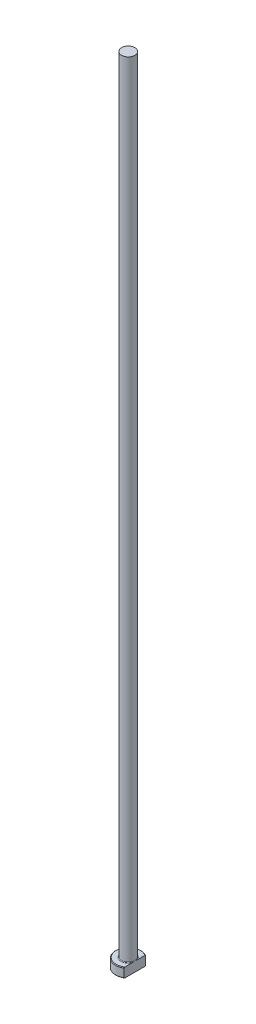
ISO-10303-21;
HEADER;
FILE_DESCRIPTION(('STEP AP214'),'2;1');
FILE_NAME('part.step','',(''),(''),'','','');
FILE_SCHEMA(('AUTOMOTIVE_DESIGN { 1 0 10303 214 1 1 1 1 }'));
ENDSEC;
DATA;
#1=APPLICATION_CONTEXT('core data for automotive mechanical design processes');
#2=APPLICATION_PROTOCOL_DEFINITION('international standard','automotive_design',2000,#1);
#3=PRODUCT_CONTEXT('',#1,'mechanical');
#4=PRODUCT('Part','Part','',(#3));
#5=PRODUCT_RELATED_PRODUCT_CATEGORY('part','',(#4));
#6=PRODUCT_DEFINITION_FORMATION('','',#4);
#7=PRODUCT_DEFINITION_CONTEXT('part definition',#1,'design');
#8=PRODUCT_DEFINITION('design','',#6,#7);
#9=PRODUCT_DEFINITION_SHAPE('','',#8);
#10=(LENGTH_UNIT() NAMED_UNIT(*) SI_UNIT(.MILLI.,.METRE.));
#11=(NAMED_UNIT(*) PLANE_ANGLE_UNIT() SI_UNIT($,.RADIAN.));
#12=(NAMED_UNIT(*) SI_UNIT($,.STERADIAN.) SOLID_ANGLE_UNIT());
#13=UNCERTAINTY_MEASURE_WITH_UNIT(LENGTH_MEASURE(1.E-05),#10,'distance_accuracy_value','');
#14=(GEOMETRIC_REPRESENTATION_CONTEXT(3) GLOBAL_UNCERTAINTY_ASSIGNED_CONTEXT((#13)) GLOBAL_UNIT_ASSIGNED_CONTEXT((#10,
#11,#12)) REPRESENTATION_CONTEXT('',''));
#15=CARTESIAN_POINT('',(0.,0.,0.));
#16=DIRECTION('',(0.,0.,1.));
#17=DIRECTION('',(1.,0.,0.));
#18=AXIS2_PLACEMENT_3D('',#15,#16,#17);
#19=CARTESIAN_POINT('',(0.,0.,0.));
#20=DIRECTION('',(0.,-1.,0.));
#21=DIRECTION('',(0.,0.,-1.));
#22=AXIS2_PLACEMENT_3D('',#19,#20,#21);
#23=PLANE('',#22);
#24=CARTESIAN_POINT('',(0.,0.,0.));
#25=DIRECTION('',(0.,-1.,0.));
#26=DIRECTION('',(0.,0.,-1.));
#27=AXIS2_PLACEMENT_3D('',#24,#25,#26);
#28=CIRCLE('',#27,3.79999999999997);
#29=CARTESIAN_POINT('',(2.09999999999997,0.,3.16701752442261));
#30=VERTEX_POINT('',#29);
#31=CARTESIAN_POINT('',(2.09999999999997,0.,-3.16701752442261));
#32=VERTEX_POINT('',#31);
#33=EDGE_CURVE('E98',#30,#32,#28,.T.);
#34=ORIENTED_EDGE('',*,*,#33,.T.);
#35=DIRECTION('',(0.,0.,1.));
#36=VECTOR('',#35,1.);
#37=CARTESIAN_POINT('',(2.09999999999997,0.,-3.40440890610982));
#38=LINE('',#37,#36);
#39=EDGE_CURVE('E83',#32,#30,#38,.T.);
#40=ORIENTED_EDGE('',*,*,#39,.T.);
#41=EDGE_LOOP('',(#34,#40));
#42=FACE_BOUND('',#41,.T.);
#43=ADVANCED_FACE('F32',(#42),#23,.T.);
#44=CARTESIAN_POINT('',(0.,259.958771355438,0.));
#45=DIRECTION('',(0.,1.,0.));
#46=DIRECTION('',(0.,0.,1.));
#47=AXIS2_PLACEMENT_3D('',#44,#45,#46);
#48=CYLINDRICAL_SURFACE('',#47,3.99999999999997);
#49=CARTESIAN_POINT('',(0.,2.80000000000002,0.));
#50=DIRECTION('',(0.,1.,0.));
#51=DIRECTION('',(0.,0.,1.));
#52=AXIS2_PLACEMENT_3D('',#49,#50,#51);
#53=CIRCLE('',#52,3.99999999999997);
#54=CARTESIAN_POINT('',(2.09999999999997,2.80000000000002,3.40440890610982));
#55=VERTEX_POINT('',#54);
#56=CARTESIAN_POINT('',(2.09999999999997,2.80000000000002,-3.40440890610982));
#57=VERTEX_POINT('',#56);
#58=EDGE_CURVE('E104',#55,#57,#53,.F.);
#59=ORIENTED_EDGE('',*,*,#58,.T.);
#60=DIRECTION('',(0.,-1.,0.));
#61=VECTOR('',#60,1.);
#62=CARTESIAN_POINT('',(2.09999999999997,250.,-3.40440890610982));
#63=LINE('',#62,#61);
#64=CARTESIAN_POINT('',(2.09999999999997,0.200000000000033,-3.40440890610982));
#65=VERTEX_POINT('',#64);
#66=EDGE_CURVE('E183',#57,#65,#63,.T.);
#67=ORIENTED_EDGE('',*,*,#66,.T.);
#68=CARTESIAN_POINT('',(0.,0.200000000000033,0.));
#69=DIRECTION('',(0.,-1.,0.));
#70=DIRECTION('',(0.,0.,-1.));
#71=AXIS2_PLACEMENT_3D('',#68,#69,#70);
#72=CIRCLE('',#71,3.99999999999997);
#73=CARTESIAN_POINT('',(2.09999999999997,0.200000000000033,3.40440890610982));
#74=VERTEX_POINT('',#73);
#75=EDGE_CURVE('E100',#65,#74,#72,.F.);
#76=ORIENTED_EDGE('',*,*,#75,.T.);
#77=DIRECTION('',(0.,-1.,0.));
#78=VECTOR('',#77,1.);
#79=CARTESIAN_POINT('',(2.09999999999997,250.,3.40440890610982));
#80=LINE('',#79,#78);
#81=EDGE_CURVE('E93',#55,#74,#80,.T.);
#82=ORIENTED_EDGE('',*,*,#81,.F.);
#83=EDGE_LOOP('',(#59,#67,#76,#82));
#84=FACE_BOUND('',#83,.T.);
#85=ADVANCED_FACE('F158',(#84),#48,.T.);
#86=CARTESIAN_POINT('',(-3.99999999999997,3.,0.));
#87=DIRECTION('',(0.,1.,0.));
#88=DIRECTION('',(0.,0.,1.));
#89=AXIS2_PLACEMENT_3D('',#86,#87,#88);
#90=PLANE('',#89);
#91=CARTESIAN_POINT('',(0.,3.,0.));
#92=DIRECTION('',(0.,1.,0.));
#93=DIRECTION('',(0.,0.,1.));
#94=AXIS2_PLACEMENT_3D('',#91,#92,#93);
#95=CIRCLE('',#94,3.8);
#96=CARTESIAN_POINT('',(2.09999999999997,3.,-3.16701752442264));
#97=VERTEX_POINT('',#96);
#98=CARTESIAN_POINT('',(2.09999999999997,3.,3.16701752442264));
#99=VERTEX_POINT('',#98);
#100=EDGE_CURVE('E178',#97,#99,#95,.T.);
#101=ORIENTED_EDGE('',*,*,#100,.T.);
#102=DIRECTION('',(0.,0.,-1.));
#103=VECTOR('',#102,1.);
#104=CARTESIAN_POINT('',(2.09999999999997,3.,0.));
#105=LINE('',#104,#103);
#106=CARTESIAN_POINT('',(2.09999999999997,2.99999999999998,0.938083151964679));
#107=VERTEX_POINT('',#106);
#108=EDGE_CURVE('E57',#99,#107,#105,.T.);
#109=ORIENTED_EDGE('',*,*,#108,.T.);
#110=CARTESIAN_POINT('',(0.,3.,0.));
#111=DIRECTION('',(0.,1.,0.));
#112=DIRECTION('',(0.,0.,1.));
#113=AXIS2_PLACEMENT_3D('',#110,#111,#112);
#114=CIRCLE('',#113,2.29999999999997);
#115=CARTESIAN_POINT('',(2.09999999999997,2.99999999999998,-0.938083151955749));
#116=VERTEX_POINT('',#115);
#117=EDGE_CURVE('E107',#107,#116,#114,.F.);
#118=ORIENTED_EDGE('',*,*,#117,.T.);
#119=EDGE_CURVE('E136',#116,#97,#105,.T.);
#120=ORIENTED_EDGE('',*,*,#119,.T.);
#121=EDGE_LOOP('',(#101,#109,#118,#120));
#122=FACE_BOUND('',#121,.T.);
#123=ADVANCED_FACE('F147',(#122),#90,.T.);
#124=CARTESIAN_POINT('',(0.,3.,0.));
#125=DIRECTION('',(0.,-1.,0.));
#126=DIRECTION('',(0.,0.,-1.));
#127=AXIS2_PLACEMENT_3D('',#124,#125,#126);
#128=CONICAL_SURFACE('',#127,3.8,0.785398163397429);
#129=ORIENTED_EDGE('',*,*,#58,.F.);
#130=CARTESIAN_POINT('',(2.09999999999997,-0.980423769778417,7.49166163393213));
#131=CARTESIAN_POINT('',(2.09999999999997,-0.831474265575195,7.33696373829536));
#132=CARTESIAN_POINT('',(2.09999999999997,-0.682692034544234,7.1821043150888));
#133=CARTESIAN_POINT('',(2.09999999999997,-0.385548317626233,6.87197961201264));
#134=CARTESIAN_POINT('',(2.09999999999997,-0.237186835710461,6.71671432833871));
#135=CARTESIAN_POINT('',(2.09999999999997,0.0590779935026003,6.40564381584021));
#136=CARTESIAN_POINT('',(2.09999999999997,0.206981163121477,6.24983841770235));
#137=CARTESIAN_POINT('',(2.09999999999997,0.502154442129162,5.9376299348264));
#138=CARTESIAN_POINT('',(2.09999999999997,0.649424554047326,5.78122685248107));
#139=CARTESIAN_POINT('',(2.09999999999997,0.940776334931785,5.47022973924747));
#140=CARTESIAN_POINT('',(2.09999999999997,1.08487085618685,5.31564775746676));
#141=CARTESIAN_POINT('',(2.09999999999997,1.37207699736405,5.0055736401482));
#142=CARTESIAN_POINT('',(2.09999999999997,1.51518862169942,4.85008150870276));
#143=CARTESIAN_POINT('',(2.09999999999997,1.80010839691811,4.53794892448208));
#144=CARTESIAN_POINT('',(2.09999999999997,1.94191674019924,4.38130864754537));
#145=CARTESIAN_POINT('',(2.09999999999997,2.22381768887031,4.0664938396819));
#146=CARTESIAN_POINT('',(2.09999999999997,2.36391033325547,3.90831934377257));
#147=CARTESIAN_POINT('',(2.09999999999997,2.60581733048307,3.63104485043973));
#148=CARTESIAN_POINT('',(2.09999999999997,2.70816653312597,3.51241214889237));
#149=CARTESIAN_POINT('',(2.09999999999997,2.9111669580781,3.27367935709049));
#150=CARTESIAN_POINT('',(2.09999999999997,3.01181801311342,3.15357912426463));
#151=CARTESIAN_POINT('',(2.09999999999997,3.2117981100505,2.91033378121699));
#152=CARTESIAN_POINT('',(2.09999999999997,3.31110514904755,2.78717050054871));
#153=CARTESIAN_POINT('',(2.09999999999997,3.50648239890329,2.53834531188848));
#154=CARTESIAN_POINT('',(2.09999999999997,3.60255343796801,2.4126840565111));
#155=CARTESIAN_POINT('',(2.09999999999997,3.79142541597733,2.15619995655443));
#156=CARTESIAN_POINT('',(2.09999999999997,3.88416307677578,2.02532985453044));
#157=CARTESIAN_POINT('',(2.09999999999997,4.01801013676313,1.82534891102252));
#158=CARTESIAN_POINT('',(2.09999999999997,4.0617809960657,1.75802258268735));
#159=CARTESIAN_POINT('',(2.09999999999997,4.14708263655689,1.6219702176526));
#160=CARTESIAN_POINT('',(2.09999999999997,4.1886136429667,1.55324432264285));
#161=CARTESIAN_POINT('',(2.09999999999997,4.26843053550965,1.41491925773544));
#162=CARTESIAN_POINT('',(2.09999999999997,4.30674712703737,1.34533804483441));
#163=CARTESIAN_POINT('',(2.09999999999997,4.37989810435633,1.20437862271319));
#164=CARTESIAN_POINT('',(2.09999999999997,4.4147318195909,1.13300007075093));
#165=CARTESIAN_POINT('',(2.09999999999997,4.5124660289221,0.916193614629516));
#166=CARTESIAN_POINT('',(2.09999999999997,4.5689063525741,0.767589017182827));
#167=CARTESIAN_POINT('',(2.09999999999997,4.63146309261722,0.54504407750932));
#168=CARTESIAN_POINT('',(2.09999999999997,4.64829911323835,0.474096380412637));
#169=CARTESIAN_POINT('',(2.09999999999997,4.67524959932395,0.330910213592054));
#170=CARTESIAN_POINT('',(2.09999999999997,4.68536485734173,0.258671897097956));
#171=CARTESIAN_POINT('',(2.09999999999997,4.69814808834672,0.11383743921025));
#172=CARTESIAN_POINT('',(2.09999999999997,4.70084750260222,0.0412441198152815));
#173=CARTESIAN_POINT('',(2.09999999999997,4.69868618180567,-0.103832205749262));
#174=CARTESIAN_POINT('',(2.09999999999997,4.69382503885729,-0.176315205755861));
#175=CARTESIAN_POINT('',(2.09999999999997,4.67696192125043,-0.319913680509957));
#176=CARTESIAN_POINT('',(2.09999999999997,4.66501009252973,-0.391035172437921));
#177=CARTESIAN_POINT('',(2.09999999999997,4.63477414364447,-0.531925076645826));
#178=CARTESIAN_POINT('',(2.09999999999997,4.61648741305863,-0.60169291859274));
#179=CARTESIAN_POINT('',(2.09999999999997,4.57440952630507,-0.740018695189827));
#180=CARTESIAN_POINT('',(2.09999999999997,4.55058348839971,-0.808565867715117));
#181=CARTESIAN_POINT('',(2.09999999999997,4.49846635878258,-0.943903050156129));
#182=CARTESIAN_POINT('',(2.09999999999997,4.47017609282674,-1.01069338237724));
#183=CARTESIAN_POINT('',(2.09999999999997,4.38350646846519,-1.2006959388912));
#184=CARTESIAN_POINT('',(2.09999999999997,4.32056256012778,-1.3218187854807));
#185=CARTESIAN_POINT('',(2.09999999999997,4.18621189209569,-1.55931752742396));
#186=CARTESIAN_POINT('',(2.09999999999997,4.11479535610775,-1.67568772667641));
#187=CARTESIAN_POINT('',(2.09999999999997,3.96595132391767,-1.90511626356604));
#188=CARTESIAN_POINT('',(2.09999999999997,3.88850194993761,-2.0181602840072));
#189=CARTESIAN_POINT('',(2.09999999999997,3.72960863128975,-2.24129989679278));
#190=CARTESIAN_POINT('',(2.09999999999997,3.64816653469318,-2.3513968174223));
#191=CARTESIAN_POINT('',(2.09999999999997,3.48133411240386,-2.57073305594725));
#192=CARTESIAN_POINT('',(2.09999999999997,3.39590709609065,-2.67994433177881));
#193=CARTESIAN_POINT('',(2.09999999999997,3.22283750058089,-2.8966072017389));
#194=CARTESIAN_POINT('',(2.09999999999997,3.13519470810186,-3.00405862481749));
#195=CARTESIAN_POINT('',(2.09999999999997,2.95843815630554,-3.2173196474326));
#196=CARTESIAN_POINT('',(2.09999999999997,2.86932829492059,-3.32313248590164));
#197=CARTESIAN_POINT('',(2.09999999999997,2.68980874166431,-3.53365081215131));
#198=CARTESIAN_POINT('',(2.09999999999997,2.59939902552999,-3.63835627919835));
#199=CARTESIAN_POINT('',(2.09999999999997,2.36547490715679,-3.90659393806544));
#200=CARTESIAN_POINT('',(2.09999999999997,2.22120602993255,-4.06946765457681));
#201=CARTESIAN_POINT('',(2.09999999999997,1.93085962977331,-4.39359699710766));
#202=CARTESIAN_POINT('',(2.09999999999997,1.78478206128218,-4.55485258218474));
#203=CARTESIAN_POINT('',(2.09999999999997,1.49115582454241,-4.87627982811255));
#204=CARTESIAN_POINT('',(2.09999999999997,1.34360596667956,-5.03645040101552));
#205=CARTESIAN_POINT('',(2.09999999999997,1.04748117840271,-5.3558413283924));
#206=CARTESIAN_POINT('',(2.09999999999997,0.89890624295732,-5.51506167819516));
#207=CARTESIAN_POINT('',(2.09999999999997,0.463656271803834,-5.97917774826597));
#208=CARTESIAN_POINT('',(2.09999999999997,0.175917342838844,-6.28307552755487));
#209=CARTESIAN_POINT('',(2.09999999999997,-0.256953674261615,-6.73740739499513));
#210=CARTESIAN_POINT('',(2.09999999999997,-0.401377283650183,-6.88851889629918));
#211=CARTESIAN_POINT('',(2.09999999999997,-0.690621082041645,-7.1903594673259));
#212=CARTESIAN_POINT('',(2.09999999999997,-0.835441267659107,-7.34108854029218));
#213=CARTESIAN_POINT('',(2.09999999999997,-0.980423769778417,-7.49166163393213));
#214=B_SPLINE_CURVE_WITH_KNOTS('',3,(#130,#131,#132,#133,#134,#135,#136,#137,#138,#139,#140,
#141,#142,#143,#144,#145,#146,#147,#148,#149,#150,#151,#152,#153,#154,#155,#156,#157,#158,#159,
#160,#161,#162,#163,#164,#165,#166,#167,#168,#169,#170,#171,#172,#173,#174,#175,#176,#177,#178,
#179,#180,#181,#182,#183,#184,#185,#186,#187,#188,#189,#190,#191,#192,#193,#194,#195,#196,#197,
#198,#199,#200,#201,#202,#203,#204,#205,#206,#207,#208,#209,#210,#211,#212,#213),.UNSPECIFIED.,
.F.,.F.,(4,2,2,2,2,2,2,2,2,2,2,2,2,2,2,2,2,2,2,2,2,2,2,2,2,2,2,2,2,2,2,2,2,2,2,2,2,2,2,2,2,4),
(0.,0.644249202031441,1.28850446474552,1.93298425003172,2.577461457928,3.21143723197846,
3.84541015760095,4.47928793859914,5.11315128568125,5.58318355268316,6.05326185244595,
6.52785804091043,7.00233182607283,7.48334172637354,7.72421875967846,7.96507152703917,
8.20327136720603,8.441516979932,8.91624038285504,9.13473354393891,9.35320093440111,
9.57074063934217,9.78829208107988,10.0043230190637,10.2204430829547,10.4379628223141,
10.6554423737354,11.0643686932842,11.4737715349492,11.8847351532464,12.2955103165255,
12.7114337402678,13.1273973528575,13.5423929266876,13.9573962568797,14.6101174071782,
15.2628550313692,15.9161714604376,16.5694910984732,17.8249945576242,18.452079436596,
19.0791589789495),.UNSPECIFIED.);
#215=EDGE_CURVE('E135',#55,#99,#214,.T.);
#216=ORIENTED_EDGE('',*,*,#215,.T.);
#217=ORIENTED_EDGE('',*,*,#100,.F.);
#218=EDGE_CURVE('E127',#97,#57,#214,.T.);
#219=ORIENTED_EDGE('',*,*,#218,.T.);
#220=EDGE_LOOP('',(#129,#216,#217,#219));
#221=FACE_BOUND('',#220,.T.);
#222=ADVANCED_FACE('F143',(#221),#128,.T.);
#223=CARTESIAN_POINT('',(0.,0.200000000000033,0.));
#224=DIRECTION('',(0.,1.,0.));
#225=DIRECTION('',(0.,0.,1.));
#226=AXIS2_PLACEMENT_3D('',#223,#224,#225);
#227=CONICAL_SURFACE('',#226,3.99999999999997,0.785398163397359);
#228=ORIENTED_EDGE('',*,*,#75,.F.);
#229=CARTESIAN_POINT('',(2.09999999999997,3.980423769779,-7.49166163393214));
#230=CARTESIAN_POINT('',(2.09999999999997,3.83147426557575,-7.33696373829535));
#231=CARTESIAN_POINT('',(2.09999999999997,3.68269203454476,-7.18210431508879));
#232=CARTESIAN_POINT('',(2.09999999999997,3.3855483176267,-6.87197961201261));
#233=CARTESIAN_POINT('',(2.09999999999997,3.23718683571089,-6.71671432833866));
#234=CARTESIAN_POINT('',(2.09999999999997,2.94092200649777,-6.40564381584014));
#235=CARTESIAN_POINT('',(2.09999999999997,2.79301883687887,-6.24983841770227));
#236=CARTESIAN_POINT('',(2.09999999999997,2.49784555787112,-5.9376299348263));
#237=CARTESIAN_POINT('',(2.09999999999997,2.35057544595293,-5.78122685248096));
#238=CARTESIAN_POINT('',(2.09999999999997,2.05922366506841,-5.47022973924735));
#239=CARTESIAN_POINT('',(2.09999999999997,1.91512914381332,-5.31564775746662));
#240=CARTESIAN_POINT('',(2.09999999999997,1.62792300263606,-5.00557364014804));
#241=CARTESIAN_POINT('',(2.09999999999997,1.48481137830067,-4.8500815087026));
#242=CARTESIAN_POINT('',(2.09999999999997,1.19989160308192,-4.53794892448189));
#243=CARTESIAN_POINT('',(2.09999999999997,1.05808325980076,-4.38130864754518));
#244=CARTESIAN_POINT('',(2.09999999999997,0.776182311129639,-4.06649383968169));
#245=CARTESIAN_POINT('',(2.09999999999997,0.636089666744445,-3.90831934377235));
#246=CARTESIAN_POINT('',(2.09999999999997,0.394182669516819,-3.6310448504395));
#247=CARTESIAN_POINT('',(2.09999999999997,0.291833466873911,-3.51241214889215));
#248=CARTESIAN_POINT('',(2.09999999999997,0.0888330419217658,-3.27367935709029));
#249=CARTESIAN_POINT('',(2.09999999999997,-0.0118180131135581,-3.15357912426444));
#250=CARTESIAN_POINT('',(2.09999999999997,-0.211798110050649,-2.9103337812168));
#251=CARTESIAN_POINT('',(2.09999999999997,-0.311105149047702,-2.78717050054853));
#252=CARTESIAN_POINT('',(2.09999999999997,-0.506482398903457,-2.53834531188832));
#253=CARTESIAN_POINT('',(2.09999999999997,-0.602553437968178,-2.41268405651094));
#254=CARTESIAN_POINT('',(2.09999999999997,-0.79142541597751,-2.15619995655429));
#255=CARTESIAN_POINT('',(2.09999999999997,-0.884163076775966,-2.02532985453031));
#256=CARTESIAN_POINT('',(2.09999999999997,-1.01801013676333,-1.82534891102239));
#257=CARTESIAN_POINT('',(2.09999999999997,-1.0617809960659,-1.75802258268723));
#258=CARTESIAN_POINT('',(2.09999999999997,-1.14708263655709,-1.62197021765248));
#259=CARTESIAN_POINT('',(2.09999999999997,-1.18861364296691,-1.55324432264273));
#260=CARTESIAN_POINT('',(2.09999999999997,-1.26843053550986,-1.41491925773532));
#261=CARTESIAN_POINT('',(2.09999999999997,-1.30674712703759,-1.34533804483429));
#262=CARTESIAN_POINT('',(2.09999999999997,-1.37989810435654,-1.20437862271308));
#263=CARTESIAN_POINT('',(2.09999999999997,-1.41473181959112,-1.13300007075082));
#264=CARTESIAN_POINT('',(2.09999999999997,-1.51246602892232,-0.916193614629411));
#265=CARTESIAN_POINT('',(2.09999999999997,-1.56890635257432,-0.767589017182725));
#266=CARTESIAN_POINT('',(2.09999999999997,-1.63146309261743,-0.545044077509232));
#267=CARTESIAN_POINT('',(2.09999999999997,-1.64829911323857,-0.47409638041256));
#268=CARTESIAN_POINT('',(2.09999999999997,-1.67524959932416,-0.330910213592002));
#269=CARTESIAN_POINT('',(2.09999999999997,-1.68536485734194,-0.258671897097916));
#270=CARTESIAN_POINT('',(2.09999999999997,-1.69814808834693,-0.113837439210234));
#271=CARTESIAN_POINT('',(2.09999999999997,-1.70084750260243,-0.0412441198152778));
#272=CARTESIAN_POINT('',(2.09999999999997,-1.69868618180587,0.103832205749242));
#273=CARTESIAN_POINT('',(2.09999999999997,-1.6938250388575,0.176315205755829));
#274=CARTESIAN_POINT('',(2.09999999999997,-1.67696192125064,0.319913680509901));
#275=CARTESIAN_POINT('',(2.09999999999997,-1.66501009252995,0.391035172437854));
#276=CARTESIAN_POINT('',(2.09999999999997,-1.63477414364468,0.531925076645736));
#277=CARTESIAN_POINT('',(2.09999999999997,-1.61648741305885,0.601692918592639));
#278=CARTESIAN_POINT('',(2.09999999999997,-1.5744095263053,0.740018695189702));
#279=CARTESIAN_POINT('',(2.09999999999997,-1.55058348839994,0.808565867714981));
#280=CARTESIAN_POINT('',(2.09999999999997,-1.49846635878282,0.94390305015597));
#281=CARTESIAN_POINT('',(2.09999999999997,-1.47017609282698,1.01069338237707));
#282=CARTESIAN_POINT('',(2.09999999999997,-1.38350646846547,1.20069593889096));
#283=CARTESIAN_POINT('',(2.09999999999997,-1.32056256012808,1.32181878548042));
#284=CARTESIAN_POINT('',(2.09999999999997,-1.18621189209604,1.55931752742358));
#285=CARTESIAN_POINT('',(2.09999999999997,-1.11479535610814,1.67568772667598));
#286=CARTESIAN_POINT('',(2.09999999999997,-0.965951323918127,1.90511626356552));
#287=CARTESIAN_POINT('',(2.09999999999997,-0.88850194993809,2.01816028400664));
#288=CARTESIAN_POINT('',(2.09999999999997,-0.729608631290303,2.24129989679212));
#289=CARTESIAN_POINT('',(2.09999999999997,-0.648166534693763,2.3513968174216));
#290=CARTESIAN_POINT('',(2.09999999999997,-0.481334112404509,2.57073305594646));
#291=CARTESIAN_POINT('',(2.09999999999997,-0.395907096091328,2.67994433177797));
#292=CARTESIAN_POINT('',(2.09999999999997,-0.222837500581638,2.89660720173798));
#293=CARTESIAN_POINT('',(2.09999999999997,-0.135194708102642,3.00405862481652));
#294=CARTESIAN_POINT('',(2.09999999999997,0.0415618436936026,3.21731964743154));
#295=CARTESIAN_POINT('',(2.09999999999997,0.130671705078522,3.32313248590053));
#296=CARTESIAN_POINT('',(2.09999999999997,0.310191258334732,3.53365081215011));
#297=CARTESIAN_POINT('',(2.09999999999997,0.400600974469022,3.6383562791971));
#298=CARTESIAN_POINT('',(2.09999999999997,0.634525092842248,3.90659393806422));
#299=CARTESIAN_POINT('',(2.09999999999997,0.778793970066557,4.06946765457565));
#300=CARTESIAN_POINT('',(2.09999999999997,1.06914037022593,4.39359699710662));
#301=CARTESIAN_POINT('',(2.09999999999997,1.21521793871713,4.55485258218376));
#302=CARTESIAN_POINT('',(2.09999999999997,1.50884417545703,4.87627982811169));
#303=CARTESIAN_POINT('',(2.09999999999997,1.65639403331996,5.03645040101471));
#304=CARTESIAN_POINT('',(2.09999999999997,1.95251882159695,5.35584132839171));
#305=CARTESIAN_POINT('',(2.09999999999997,2.10109375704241,5.51506167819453));
#306=CARTESIAN_POINT('',(2.09999999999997,2.5363437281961,5.9791777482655));
#307=CARTESIAN_POINT('',(2.09999999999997,2.82408265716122,6.28307552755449));
#308=CARTESIAN_POINT('',(2.09999999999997,3.25695367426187,6.73740739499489));
#309=CARTESIAN_POINT('',(2.09999999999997,3.40137728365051,6.88851889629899));
#310=CARTESIAN_POINT('',(2.09999999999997,3.6906210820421,7.1903594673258));
#311=CARTESIAN_POINT('',(2.09999999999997,3.83544126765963,7.34108854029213));
#312=CARTESIAN_POINT('',(2.09999999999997,3.980423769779,7.49166163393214));
#313=B_SPLINE_CURVE_WITH_KNOTS('',3,(#229,#230,#231,#232,#233,#234,#235,#236,#237,#238,#239,
#240,#241,#242,#243,#244,#245,#246,#247,#248,#249,#250,#251,#252,#253,#254,#255,#256,#257,#258,
#259,#260,#261,#262,#263,#264,#265,#266,#267,#268,#269,#270,#271,#272,#273,#274,#275,#276,#277,
#278,#279,#280,#281,#282,#283,#284,#285,#286,#287,#288,#289,#290,#291,#292,#293,#294,#295,#296,
#297,#298,#299,#300,#301,#302,#303,#304,#305,#306,#307,#308,#309,#310,#311,#312),.UNSPECIFIED.,
.F.,.F.,(4,2,2,2,2,2,2,2,2,2,2,2,2,2,2,2,2,2,2,2,2,2,2,2,2,2,2,2,2,2,2,2,2,2,2,2,2,2,2,2,2,4),
(0.,0.644249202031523,1.28850446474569,1.93298425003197,2.57746145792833,3.21143723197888,
3.84541015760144,4.4792879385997,5.11315128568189,5.5831835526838,6.05326185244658,
6.52785804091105,7.00233182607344,7.48334172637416,7.72421875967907,7.96507152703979,
8.20327136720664,8.4415169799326,8.91624038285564,9.13473354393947,9.35320093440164,
9.57074063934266,9.78829208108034,10.0043230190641,10.2204430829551,10.4379628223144,
10.6554423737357,11.0643686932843,11.4737715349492,11.8847351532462,12.2955103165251,
12.7114337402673,13.1273973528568,13.5423929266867,13.9573962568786,14.6101174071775,
15.2628550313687,15.9161714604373,16.5694910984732,17.8249945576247,18.4520794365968,
19.0791589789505),.UNSPECIFIED.);
#314=EDGE_CURVE('E86',#65,#32,#313,.T.);
#315=ORIENTED_EDGE('',*,*,#314,.T.);
#316=ORIENTED_EDGE('',*,*,#33,.F.);
#317=EDGE_CURVE('E89',#30,#74,#313,.T.);
#318=ORIENTED_EDGE('',*,*,#317,.T.);
#319=EDGE_LOOP('',(#228,#315,#316,#318));
#320=FACE_BOUND('',#319,.T.);
#321=ADVANCED_FACE('F97',(#320),#227,.T.);
#322=CARTESIAN_POINT('',(0.,3.19999999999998,0.));
#323=DIRECTION('',(0.,1.,0.));
#324=DIRECTION('',(0.,0.,1.));
#325=AXIS2_PLACEMENT_3D('',#322,#323,#324);
#326=TOROIDAL_SURFACE('',#325,2.29999999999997,0.2);
#327=CARTESIAN_POINT('',(2.09999999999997,3.19999999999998,0.));
#328=CARTESIAN_POINT('',(2.09999999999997,3.20000050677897,1.12871213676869E-10));
#329=CARTESIAN_POINT('',(2.09999999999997,3.20000101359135,-1.5160230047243E-07));
#330=CARTESIAN_POINT('',(2.09999999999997,3.20000197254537,-5.98005719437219E-07));
#331=CARTESIAN_POINT('',(2.09999999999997,3.2000024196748,-9.0062574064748E-07));
#332=CARTESIAN_POINT('',(2.09999999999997,3.20000332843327,-1.62318945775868E-06));
#333=CARTESIAN_POINT('',(2.09999999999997,3.20000378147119,-2.05406588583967E-06));
#334=CARTESIAN_POINT('',(2.09999999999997,3.20000461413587,-2.96308561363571E-06));
#335=CARTESIAN_POINT('',(2.09999999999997,3.20000499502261,-3.4401425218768E-06));
#336=CARTESIAN_POINT('',(2.09999999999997,3.20000634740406,-5.22586037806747E-06));
#337=CARTESIAN_POINT('',(2.09999999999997,3.20000724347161,-6.59340897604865E-06));
#338=CARTESIAN_POINT('',(2.09999999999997,3.20000877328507,-9.35203600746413E-06));
#339=CARTESIAN_POINT('',(2.09999999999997,3.20000941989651,-1.07363396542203E-05));
#340=CARTESIAN_POINT('',(2.09999999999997,3.20001201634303,-1.6407290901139E-05));
#341=CARTESIAN_POINT('',(2.09999999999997,3.20001387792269,-2.07387533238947E-05));
#342=CARTESIAN_POINT('',(2.09999999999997,3.2000167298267,-2.90585196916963E-05));
#343=CARTESIAN_POINT('',(2.09999999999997,3.20001780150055,-3.30191375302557E-05));
#344=CARTESIAN_POINT('',(2.09999999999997,3.20002541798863,-6.18759983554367E-05));
#345=CARTESIAN_POINT('',(2.09999999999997,3.20003100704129,-8.69774695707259E-05));
#346=CARTESIAN_POINT('',(2.09999999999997,3.20005545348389,-0.000185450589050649));
#347=CARTESIAN_POINT('',(2.09999999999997,3.20007895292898,-0.000257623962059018));
#348=CARTESIAN_POINT('',(2.09999999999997,3.20016974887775,-0.000541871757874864));
#349=CARTESIAN_POINT('',(2.09999999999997,3.20023388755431,-0.000754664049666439));
#350=CARTESIAN_POINT('',(2.09999999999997,3.20048929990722,-0.00159500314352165));
#351=CARTESIAN_POINT('',(2.09999999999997,3.2006844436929,-0.00222165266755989));
#352=CARTESIAN_POINT('',(2.09999999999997,3.2014903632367,-0.00481735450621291));
#353=CARTESIAN_POINT('',(2.09999999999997,3.2020963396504,-0.0067875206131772));
#354=CARTESIAN_POINT('',(2.09999999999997,3.20811857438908,-0.0263575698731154));
#355=CARTESIAN_POINT('',(2.09999999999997,3.21355673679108,-0.0439525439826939));
#356=CARTESIAN_POINT('',(2.09999999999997,3.22417769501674,-0.078471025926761));
#357=CARTESIAN_POINT('',(2.09999999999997,3.22936219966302,-0.0953940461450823));
#358=CARTESIAN_POINT('',(2.09999999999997,3.24031741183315,-0.131344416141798));
#359=CARTESIAN_POINT('',(2.09999999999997,3.24608153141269,-0.150373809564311));
#360=CARTESIAN_POINT('',(2.09999999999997,3.25756719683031,-0.188666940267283));
#361=CARTESIAN_POINT('',(2.09999999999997,3.263287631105,-0.207931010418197));
#362=CARTESIAN_POINT('',(2.09999999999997,3.27708776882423,-0.255037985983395));
#363=CARTESIAN_POINT('',(2.09999999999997,3.2850908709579,-0.282903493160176));
#364=CARTESIAN_POINT('',(2.09999999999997,3.30049018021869,-0.33805925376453));
#365=CARTESIAN_POINT('',(2.09999999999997,3.30789650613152,-0.365346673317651));
#366=CARTESIAN_POINT('',(2.09999999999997,3.32422959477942,-0.427831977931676));
#367=CARTESIAN_POINT('',(2.09999999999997,3.33299018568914,-0.46307381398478));
#368=CARTESIAN_POINT('',(2.09999999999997,3.34944378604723,-0.534083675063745));
#369=CARTESIAN_POINT('',(2.09999999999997,3.35712842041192,-0.569853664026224));
#370=CARTESIAN_POINT('',(2.09999999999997,3.37150595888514,-0.644262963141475));
#371=CARTESIAN_POINT('',(2.09999999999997,3.37808822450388,-0.682924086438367));
#372=CARTESIAN_POINT('',(2.09999999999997,3.38900927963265,-0.760558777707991));
#373=CARTESIAN_POINT('',(2.09999999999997,3.39334901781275,-0.799532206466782));
#374=CARTESIAN_POINT('',(2.09999999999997,3.39885385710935,-0.874699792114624));
#375=CARTESIAN_POINT('',(2.09999999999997,3.40023755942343,-0.910877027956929));
#376=CARTESIAN_POINT('',(2.09999999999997,3.39969515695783,-0.983205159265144));
#377=CARTESIAN_POINT('',(2.09999999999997,3.39777304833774,-1.01935603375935));
#378=CARTESIAN_POINT('',(2.09999999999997,3.39020522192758,-1.08431292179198));
#379=CARTESIAN_POINT('',(2.09999999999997,3.38533825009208,-1.11320671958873));
#380=CARTESIAN_POINT('',(2.09999999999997,3.37160685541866,-1.1700898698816));
#381=CARTESIAN_POINT('',(2.09999999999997,3.36275087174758,-1.19808099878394));
#382=CARTESIAN_POINT('',(2.09999999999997,3.34648318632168,-1.23525714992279));
#383=CARTESIAN_POINT('',(2.09999999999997,3.34148711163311,-1.24549622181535));
#384=CARTESIAN_POINT('',(2.09999999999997,3.33045865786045,-1.26542566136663));
#385=CARTESIAN_POINT('',(2.09999999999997,3.32442526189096,-1.27511547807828));
#386=CARTESIAN_POINT('',(2.09999999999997,3.31108244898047,-1.29375285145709));
#387=CARTESIAN_POINT('',(2.09999999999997,3.30375956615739,-1.30269093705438));
#388=CARTESIAN_POINT('',(2.09999999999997,3.28770931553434,-1.31920846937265));
#389=CARTESIAN_POINT('',(2.09999999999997,3.27898657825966,-1.32679222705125));
#390=CARTESIAN_POINT('',(2.09999999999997,3.26379332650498,-1.33730272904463));
#391=CARTESIAN_POINT('',(2.09999999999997,3.25778099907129,-1.34088947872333));
#392=CARTESIAN_POINT('',(2.09999999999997,3.24526530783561,-1.34707853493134));
#393=CARTESIAN_POINT('',(2.09999999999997,3.23876236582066,-1.34968167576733));
#394=CARTESIAN_POINT('',(2.09999999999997,3.22533138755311,-1.35371298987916));
#395=CARTESIAN_POINT('',(2.09999999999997,3.21840009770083,-1.35513055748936));
#396=CARTESIAN_POINT('',(2.09999999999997,3.2043942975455,-1.35660326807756));
#397=CARTESIAN_POINT('',(2.09999999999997,3.19731988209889,-1.35665928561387));
#398=CARTESIAN_POINT('',(2.09999999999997,3.18410044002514,-1.35547833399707));
#399=CARTESIAN_POINT('',(2.09999999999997,3.17794157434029,-1.3543883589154));
#400=CARTESIAN_POINT('',(2.09999999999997,3.16588195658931,-1.35123020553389));
#401=CARTESIAN_POINT('',(2.09999999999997,3.15998132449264,-1.34916157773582));
#402=CARTESIAN_POINT('',(2.09999999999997,3.14673410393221,-1.34339681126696));
#403=CARTESIAN_POINT('',(2.09999999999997,3.13952216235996,-1.33939261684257));
#404=CARTESIAN_POINT('',(2.09999999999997,3.1258371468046,-1.33027651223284));
#405=CARTESIAN_POINT('',(2.09999999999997,3.11936569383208,-1.3251622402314));
#406=CARTESIAN_POINT('',(2.09999999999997,3.10400061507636,-1.31126465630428));
#407=CARTESIAN_POINT('',(2.09999999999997,3.09558831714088,-1.3019528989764));
#408=CARTESIAN_POINT('',(2.09999999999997,3.0802757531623,-1.28218529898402));
#409=CARTESIAN_POINT('',(2.09999999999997,3.07337755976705,-1.27172791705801));
#410=CARTESIAN_POINT('',(2.09999999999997,3.05595453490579,-1.24164701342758));
#411=CARTESIAN_POINT('',(2.09999999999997,3.0467992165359,-1.22123760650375));
#412=CARTESIAN_POINT('',(2.09999999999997,3.03140603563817,-1.17923303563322));
#413=CARTESIAN_POINT('',(2.09999999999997,3.02519350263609,-1.15762930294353));
#414=CARTESIAN_POINT('',(2.09999999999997,3.014897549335,-1.11311363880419));
#415=CARTESIAN_POINT('',(2.09999999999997,3.01089884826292,-1.09018261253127));
#416=CARTESIAN_POINT('',(2.09999999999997,3.00485282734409,-1.04403569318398));
#417=CARTESIAN_POINT('',(2.09999999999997,3.00280937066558,-1.02081932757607));
#418=CARTESIAN_POINT('',(2.09999999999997,2.99913236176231,-0.952629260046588));
#419=CARTESIAN_POINT('',(2.09999999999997,2.99965574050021,-0.907543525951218));
#420=CARTESIAN_POINT('',(2.09999999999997,3.00580977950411,-0.79983290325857));
#421=CARTESIAN_POINT('',(2.09999999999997,3.01338406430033,-0.737345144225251));
#422=CARTESIAN_POINT('',(2.09999999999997,3.03389167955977,-0.611758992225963));
#423=CARTESIAN_POINT('',(2.09999999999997,3.04695134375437,-0.548682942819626));
#424=CARTESIAN_POINT('',(2.09999999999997,3.07174522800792,-0.44346393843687));
#425=CARTESIAN_POINT('',(2.09999999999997,3.08256100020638,-0.401095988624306));
#426=CARTESIAN_POINT('',(2.09999999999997,3.10517491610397,-0.317118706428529));
#427=CARTESIAN_POINT('',(2.09999999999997,3.11696109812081,-0.275506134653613));
#428=CARTESIAN_POINT('',(2.09999999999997,3.13984946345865,-0.197106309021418));
#429=CARTESIAN_POINT('',(2.09999999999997,3.15088145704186,-0.160298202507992));
#430=CARTESIAN_POINT('',(2.09999999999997,3.17371469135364,-0.0852465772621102));
#431=CARTESIAN_POINT('',(2.09999999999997,3.18552885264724,-0.0470069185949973));
#432=CARTESIAN_POINT('',(2.09999999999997,3.1979046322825,-0.00678406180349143));
#433=CARTESIAN_POINT('',(2.09999999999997,3.19851173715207,-0.0048104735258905));
#434=CARTESIAN_POINT('',(2.09999999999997,3.19931792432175,-0.00221397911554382));
#435=CARTESIAN_POINT('',(2.09999999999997,3.19951224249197,-0.00158996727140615));
#436=CARTESIAN_POINT('',(2.09999999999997,3.19976664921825,-0.000752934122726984));
#437=CARTESIAN_POINT('',(2.09999999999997,3.1998305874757,-0.000540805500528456));
#438=CARTESIAN_POINT('',(2.09999999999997,3.19992113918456,-0.00025733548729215));
#439=CARTESIAN_POINT('',(2.09999999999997,3.19994460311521,-0.000185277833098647));
#440=CARTESIAN_POINT('',(2.09999999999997,3.19996901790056,-8.69395480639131E-05));
#441=CARTESIAN_POINT('',(2.09999999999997,3.1999746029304,-6.18551879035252E-05));
#442=CARTESIAN_POINT('',(2.09999999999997,3.19998221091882,-3.30155874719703E-05));
#443=CARTESIAN_POINT('',(2.09999999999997,3.19998328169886,-2.90560037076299E-05));
#444=CARTESIAN_POINT('',(2.09999999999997,3.19998613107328,-2.07382812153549E-05));
#445=CARTESIAN_POINT('',(2.09999999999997,3.19998799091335,-1.64077754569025E-05));
#446=CARTESIAN_POINT('',(2.09999999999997,3.19999058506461,-1.0737787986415E-05));
#447=CARTESIAN_POINT('',(2.09999999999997,3.19999123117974,-9.35356155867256E-06));
#448=CARTESIAN_POINT('',(2.09999999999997,3.19999275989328,-6.59500016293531E-06));
#449=CARTESIAN_POINT('',(2.09999999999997,3.19999365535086,-5.22743189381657E-06));
#450=CARTESIAN_POINT('',(2.09999999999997,3.19999500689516,-3.44158185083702E-06));
#451=CARTESIAN_POINT('',(2.09999999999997,3.19999538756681,-2.96446374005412E-06));
#452=CARTESIAN_POINT('',(2.09999999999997,3.19999621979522,-2.05528284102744E-06));
#453=CARTESIAN_POINT('',(2.09999999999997,3.1999966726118,-1.62430552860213E-06));
#454=CARTESIAN_POINT('',(2.09999999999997,3.19999758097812,-9.01501322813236E-07));
#455=CARTESIAN_POINT('',(2.09999999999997,3.19999802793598,-5.98749119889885E-07));
#456=CARTESIAN_POINT('',(2.09999999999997,3.19999898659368,-1.52018312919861E-07));
#457=CARTESIAN_POINT('',(2.09999999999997,3.19999949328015,-1.12858037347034E-10));
#458=CARTESIAN_POINT('',(2.09999999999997,3.19999999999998,0.));
#459=B_SPLINE_CURVE_WITH_KNOTS('',3,(#327,#328,#329,#330,#331,#332,#333,#334,#335,#336,#337,
#338,#339,#340,#341,#342,#343,#344,#345,#346,#347,#348,#349,#350,#351,#352,#353,#354,#355,#356,
#357,#358,#359,#360,#361,#362,#363,#364,#365,#366,#367,#368,#369,#370,#371,#372,#373,#374,#375,
#376,#377,#378,#379,#380,#381,#382,#383,#384,#385,#386,#387,#388,#389,#390,#391,#392,#393,#394,
#395,#396,#397,#398,#399,#400,#401,#402,#403,#404,#405,#406,#407,#408,#409,#410,#411,#412,#413,
#414,#415,#416,#417,#418,#419,#420,#421,#422,#423,#424,#425,#426,#427,#428,#429,#430,#431,#432,
#433,#434,#435,#436,#437,#438,#439,#440,#441,#442,#443,#444,#445,#446,#447,#448,#449,#450,#451,
#452,#453,#454,#455,#456,#457,#458),.UNSPECIFIED.,.T.,.F.,(4,2,2,2,2,2,2,2,2,2,2,2,2,2,2,2,2,2,
2,2,2,2,2,2,2,2,2,2,2,2,2,2,2,2,2,2,2,2,2,2,2,2,2,2,2,2,2,2,2,2,2,2,2,2,2,2,2,2,2,2,2,2,2,2,2,
4),(0.,1.52446483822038E-06,3.13917159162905E-06,5.00540711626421E-06,6.83522638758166E-06,
1.1719467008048E-05,1.62993936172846E-05,3.04103902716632E-05,4.27033722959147E-05,
0.000119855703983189,0.000347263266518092,0.00101430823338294,0.002982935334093,
0.00916710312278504,0.0644134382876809,0.117512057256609,0.17716136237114,0.237447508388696,
0.324420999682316,0.409241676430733,0.518170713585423,0.627905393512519,0.745509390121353,
0.863063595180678,0.971571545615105,1.07994842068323,1.1676881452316,1.25524311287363,
1.28937713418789,1.32354480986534,1.35809310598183,1.39252939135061,1.41346149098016,
1.43437579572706,1.45547524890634,1.47656114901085,1.49523795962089,1.51392335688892,
1.53853256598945,1.56319465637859,1.60062921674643,1.63811470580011,1.7048463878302,
1.77214245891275,1.84186170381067,1.91171841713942,2.04668000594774,2.23517885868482,
2.42828019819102,2.55944432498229,2.68918212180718,2.80445903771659,2.9245225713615,
2.93071753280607,2.93267787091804,2.93334283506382,2.93356987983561,2.93364697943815,
2.93365926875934,2.93367337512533,2.93367795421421,2.93368283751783,2.93368466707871,
2.9336865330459,2.93368814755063,2.93368967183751),.UNSPECIFIED.);
#460=CARTESIAN_POINT('',(2.09999999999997,3.19999999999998,0.));
#461=VERTEX_POINT('',#460);
#462=EDGE_CURVE('E11',#116,#461,#459,.T.);
#463=ORIENTED_EDGE('',*,*,#462,.F.);
#464=ORIENTED_EDGE('',*,*,#117,.F.);
#465=CARTESIAN_POINT('',(2.09999999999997,3.19999999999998,0.));
#466=CARTESIAN_POINT('',(2.09999999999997,3.19999949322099,-1.12871210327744E-10));
#467=CARTESIAN_POINT('',(2.09999999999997,3.19999898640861,1.51602300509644E-07));
#468=CARTESIAN_POINT('',(2.09999999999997,3.19999802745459,5.98005719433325E-07));
#469=CARTESIAN_POINT('',(2.09999999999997,3.19999758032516,9.00625740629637E-07));
#470=CARTESIAN_POINT('',(2.09999999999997,3.19999667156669,1.62318945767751E-06));
#471=CARTESIAN_POINT('',(2.09999999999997,3.19999621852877,2.05406588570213E-06));
#472=CARTESIAN_POINT('',(2.09999999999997,3.1999953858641,2.96308561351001E-06));
#473=CARTESIAN_POINT('',(2.09999999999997,3.19999500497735,3.4401425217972E-06));
#474=CARTESIAN_POINT('',(2.09999999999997,3.1999936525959,5.22586037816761E-06));
#475=CARTESIAN_POINT('',(2.09999999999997,3.19999275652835,6.5934089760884E-06));
#476=CARTESIAN_POINT('',(2.09999999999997,3.19999122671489,9.3520360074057E-06));
#477=CARTESIAN_POINT('',(2.09999999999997,3.19999058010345,1.0736339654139E-05));
#478=CARTESIAN_POINT('',(2.09999999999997,3.19998798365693,1.64072909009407E-05));
#479=CARTESIAN_POINT('',(2.09999999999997,3.19998612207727,2.07387533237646E-05));
#480=CARTESIAN_POINT('',(2.09999999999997,3.19998327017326,2.90585196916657E-05));
#481=CARTESIAN_POINT('',(2.09999999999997,3.19998219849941,3.30191375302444E-05));
#482=CARTESIAN_POINT('',(2.09999999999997,3.19997458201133,6.18759983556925E-05));
#483=CARTESIAN_POINT('',(2.09999999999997,3.19996899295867,8.69774695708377E-05));
#484=CARTESIAN_POINT('',(2.09999999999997,3.19994454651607,0.000185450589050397));
#485=CARTESIAN_POINT('',(2.09999999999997,3.19992104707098,0.000257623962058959));
#486=CARTESIAN_POINT('',(2.09999999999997,3.19983025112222,0.000541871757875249));
#487=CARTESIAN_POINT('',(2.09999999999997,3.19976611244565,0.000754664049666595));
#488=CARTESIAN_POINT('',(2.09999999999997,3.19951070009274,0.00159500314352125));
#489=CARTESIAN_POINT('',(2.09999999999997,3.19931555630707,0.00222165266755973));
#490=CARTESIAN_POINT('',(2.09999999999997,3.19850963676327,0.00481735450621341));
#491=CARTESIAN_POINT('',(2.09999999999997,3.19790366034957,0.00678752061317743));
#492=CARTESIAN_POINT('',(2.09999999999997,3.19188142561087,0.0263575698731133));
#493=CARTESIAN_POINT('',(2.09999999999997,3.18644326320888,0.0439525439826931));
#494=CARTESIAN_POINT('',(2.09999999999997,3.17582230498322,0.0784710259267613));
#495=CARTESIAN_POINT('',(2.09999999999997,3.17063780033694,0.0953940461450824));
#496=CARTESIAN_POINT('',(2.09999999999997,3.15968258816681,0.131344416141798));
#497=CARTESIAN_POINT('',(2.09999999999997,3.15391846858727,0.150373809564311));
#498=CARTESIAN_POINT('',(2.09999999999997,3.14243280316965,0.188666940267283));
#499=CARTESIAN_POINT('',(2.09999999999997,3.13671236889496,0.207931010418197));
#500=CARTESIAN_POINT('',(2.09999999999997,3.12291223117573,0.255037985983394));
#501=CARTESIAN_POINT('',(2.09999999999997,3.11490912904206,0.282903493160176));
#502=CARTESIAN_POINT('',(2.09999999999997,3.09950981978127,0.33805925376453));
#503=CARTESIAN_POINT('',(2.09999999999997,3.09210349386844,0.365346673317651));
#504=CARTESIAN_POINT('',(2.09999999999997,3.07577040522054,0.427831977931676));
#505=CARTESIAN_POINT('',(2.09999999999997,3.06700981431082,0.46307381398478));
#506=CARTESIAN_POINT('',(2.09999999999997,3.05055621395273,0.534083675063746));
#507=CARTESIAN_POINT('',(2.09999999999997,3.04287157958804,0.569853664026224));
#508=CARTESIAN_POINT('',(2.09999999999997,3.02849404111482,0.644262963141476));
#509=CARTESIAN_POINT('',(2.09999999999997,3.02191177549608,0.682924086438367));
#510=CARTESIAN_POINT('',(2.09999999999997,3.01099072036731,0.760558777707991));
#511=CARTESIAN_POINT('',(2.09999999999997,3.00665098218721,0.799532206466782));
#512=CARTESIAN_POINT('',(2.09999999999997,3.00114614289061,0.874699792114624));
#513=CARTESIAN_POINT('',(2.09999999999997,2.99976244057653,0.910877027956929));
#514=CARTESIAN_POINT('',(2.09999999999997,3.00030484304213,0.983205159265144));
#515=CARTESIAN_POINT('',(2.09999999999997,3.00222695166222,1.01935603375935));
#516=CARTESIAN_POINT('',(2.09999999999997,3.00979477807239,1.08431292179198));
#517=CARTESIAN_POINT('',(2.09999999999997,3.01466174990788,1.11320671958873));
#518=CARTESIAN_POINT('',(2.09999999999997,3.0283931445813,1.1700898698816));
#519=CARTESIAN_POINT('',(2.09999999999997,3.03724912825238,1.19808099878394));
#520=CARTESIAN_POINT('',(2.09999999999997,3.05351681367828,1.23525714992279));
#521=CARTESIAN_POINT('',(2.09999999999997,3.05851288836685,1.24549622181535));
#522=CARTESIAN_POINT('',(2.09999999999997,3.06954134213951,1.26542566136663));
#523=CARTESIAN_POINT('',(2.09999999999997,3.075574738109,1.27511547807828));
#524=CARTESIAN_POINT('',(2.09999999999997,3.08891755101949,1.29375285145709));
#525=CARTESIAN_POINT('',(2.09999999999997,3.09624043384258,1.30269093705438));
#526=CARTESIAN_POINT('',(2.09999999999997,3.11229068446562,1.31920846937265));
#527=CARTESIAN_POINT('',(2.09999999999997,3.1210134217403,1.32679222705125));
#528=CARTESIAN_POINT('',(2.09999999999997,3.13620667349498,1.33730272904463));
#529=CARTESIAN_POINT('',(2.09999999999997,3.14221900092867,1.34088947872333));
#530=CARTESIAN_POINT('',(2.09999999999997,3.15473469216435,1.34707853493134));
#531=CARTESIAN_POINT('',(2.09999999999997,3.1612376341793,1.34968167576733));
#532=CARTESIAN_POINT('',(2.09999999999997,3.17466861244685,1.35371298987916));
#533=CARTESIAN_POINT('',(2.09999999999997,3.18159990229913,1.35513055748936));
#534=CARTESIAN_POINT('',(2.09999999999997,3.19560570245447,1.35660326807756));
#535=CARTESIAN_POINT('',(2.09999999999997,3.20268011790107,1.35665928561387));
#536=CARTESIAN_POINT('',(2.09999999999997,3.21589955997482,1.35547833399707));
#537=CARTESIAN_POINT('',(2.09999999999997,3.22205842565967,1.3543883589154));
#538=CARTESIAN_POINT('',(2.09999999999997,3.23411804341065,1.35123020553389));
#539=CARTESIAN_POINT('',(2.09999999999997,3.24001867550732,1.34916157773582));
#540=CARTESIAN_POINT('',(2.09999999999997,3.25326589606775,1.34339681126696));
#541=CARTESIAN_POINT('',(2.09999999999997,3.26047783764,1.33939261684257));
#542=CARTESIAN_POINT('',(2.09999999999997,3.27416285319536,1.33027651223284));
#543=CARTESIAN_POINT('',(2.09999999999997,3.28063430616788,1.3251622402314));
#544=CARTESIAN_POINT('',(2.09999999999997,3.2959993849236,1.31126465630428));
#545=CARTESIAN_POINT('',(2.09999999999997,3.30441168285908,1.3019528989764));
#546=CARTESIAN_POINT('',(2.09999999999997,3.31972424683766,1.28218529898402));
#547=CARTESIAN_POINT('',(2.09999999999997,3.32662244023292,1.27172791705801));
#548=CARTESIAN_POINT('',(2.09999999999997,3.34404546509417,1.24164701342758));
#549=CARTESIAN_POINT('',(2.09999999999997,3.35320078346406,1.22123760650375));
#550=CARTESIAN_POINT('',(2.09999999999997,3.36859396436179,1.17923303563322));
#551=CARTESIAN_POINT('',(2.09999999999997,3.37480649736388,1.15762930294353));
#552=CARTESIAN_POINT('',(2.09999999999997,3.38510245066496,1.11311363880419));
#553=CARTESIAN_POINT('',(2.09999999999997,3.38910115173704,1.09018261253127));
#554=CARTESIAN_POINT('',(2.09999999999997,3.39514717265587,1.04403569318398));
#555=CARTESIAN_POINT('',(2.09999999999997,3.39719062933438,1.02081932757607));
#556=CARTESIAN_POINT('',(2.09999999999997,3.40086763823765,0.952629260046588));
#557=CARTESIAN_POINT('',(2.09999999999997,3.40034425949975,0.907543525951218));
#558=CARTESIAN_POINT('',(2.09999999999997,3.39419022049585,0.79983290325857));
#559=CARTESIAN_POINT('',(2.09999999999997,3.38661593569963,0.737345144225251));
#560=CARTESIAN_POINT('',(2.09999999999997,3.36610832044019,0.611758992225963));
#561=CARTESIAN_POINT('',(2.09999999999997,3.35304865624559,0.548682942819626));
#562=CARTESIAN_POINT('',(2.09999999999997,3.32825477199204,0.44346393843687));
#563=CARTESIAN_POINT('',(2.09999999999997,3.31743899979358,0.401095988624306));
#564=CARTESIAN_POINT('',(2.09999999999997,3.29482508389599,0.317118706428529));
#565=CARTESIAN_POINT('',(2.09999999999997,3.28303890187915,0.275506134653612));
#566=CARTESIAN_POINT('',(2.09999999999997,3.26015053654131,0.197106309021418));
#567=CARTESIAN_POINT('',(2.09999999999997,3.2491185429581,0.160298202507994));
#568=CARTESIAN_POINT('',(2.09999999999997,3.22628530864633,0.0852465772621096));
#569=CARTESIAN_POINT('',(2.09999999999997,3.21447114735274,0.0470069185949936));
#570=CARTESIAN_POINT('',(2.09999999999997,3.20209536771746,0.00678406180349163));
#571=CARTESIAN_POINT('',(2.09999999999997,3.20148826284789,0.00481047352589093));
#572=CARTESIAN_POINT('',(2.09999999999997,3.20068207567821,0.00221397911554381));
#573=CARTESIAN_POINT('',(2.09999999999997,3.20048775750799,0.00158996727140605));
#574=CARTESIAN_POINT('',(2.09999999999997,3.20023335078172,0.000752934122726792));
#575=CARTESIAN_POINT('',(2.09999999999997,3.20016941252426,0.000540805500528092));
#576=CARTESIAN_POINT('',(2.09999999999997,3.2000788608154,0.000257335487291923));
#577=CARTESIAN_POINT('',(2.09999999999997,3.20005539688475,0.000185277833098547));
#578=CARTESIAN_POINT('',(2.09999999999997,3.2000309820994,8.69395480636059E-05));
#579=CARTESIAN_POINT('',(2.09999999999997,3.20002539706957,6.18551879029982E-05));
#580=CARTESIAN_POINT('',(2.09999999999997,3.20001778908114,3.30155874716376E-05));
#581=CARTESIAN_POINT('',(2.09999999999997,3.2000167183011,2.90560037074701E-05));
#582=CARTESIAN_POINT('',(2.09999999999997,3.20001386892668,2.07382812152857E-05));
#583=CARTESIAN_POINT('',(2.09999999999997,3.20001200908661,1.64077754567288E-05));
#584=CARTESIAN_POINT('',(2.09999999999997,3.20000941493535,1.07377879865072E-05));
#585=CARTESIAN_POINT('',(2.09999999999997,3.20000876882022,9.35356155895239E-06));
#586=CARTESIAN_POINT('',(2.09999999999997,3.20000724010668,6.59500016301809E-06));
#587=CARTESIAN_POINT('',(2.09999999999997,3.2000063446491,5.22743189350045E-06));
#588=CARTESIAN_POINT('',(2.09999999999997,3.2000049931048,3.44158185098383E-06));
#589=CARTESIAN_POINT('',(2.09999999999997,3.20000461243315,2.96446374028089E-06));
#590=CARTESIAN_POINT('',(2.09999999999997,3.20000378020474,2.05528284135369E-06));
#591=CARTESIAN_POINT('',(2.09999999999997,3.20000332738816,1.62430552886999E-06));
#592=CARTESIAN_POINT('',(2.09999999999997,3.20000241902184,9.01501323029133E-07));
#593=CARTESIAN_POINT('',(2.09999999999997,3.20000197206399,5.98749120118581E-07));
#594=CARTESIAN_POINT('',(2.09999999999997,3.20000101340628,1.52018313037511E-07));
#595=CARTESIAN_POINT('',(2.09999999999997,3.20000050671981,1.1285803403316E-10));
#596=CARTESIAN_POINT('',(2.09999999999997,3.19999999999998,0.));
#597=B_SPLINE_CURVE_WITH_KNOTS('',3,(#465,#466,#467,#468,#469,#470,#471,#472,#473,#474,#475,
#476,#477,#478,#479,#480,#481,#482,#483,#484,#485,#486,#487,#488,#489,#490,#491,#492,#493,#494,
#495,#496,#497,#498,#499,#500,#501,#502,#503,#504,#505,#506,#507,#508,#509,#510,#511,#512,#513,
#514,#515,#516,#517,#518,#519,#520,#521,#522,#523,#524,#525,#526,#527,#528,#529,#530,#531,#532,
#533,#534,#535,#536,#537,#538,#539,#540,#541,#542,#543,#544,#545,#546,#547,#548,#549,#550,#551,
#552,#553,#554,#555,#556,#557,#558,#559,#560,#561,#562,#563,#564,#565,#566,#567,#568,#569,#570,
#571,#572,#573,#574,#575,#576,#577,#578,#579,#580,#581,#582,#583,#584,#585,#586,#587,#588,#589,
#590,#591,#592,#593,#594,#595,#596),.UNSPECIFIED.,.T.,.F.,(4,2,2,2,2,2,2,2,2,2,2,2,2,2,2,2,2,2,
2,2,2,2,2,2,2,2,2,2,2,2,2,2,2,2,2,2,2,2,2,2,2,2,2,2,2,2,2,2,2,2,2,2,2,2,2,2,2,2,2,2,2,2,2,2,2,
4),(0.,1.52446483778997E-06,3.13917159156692E-06,5.00540711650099E-06,6.83522638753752E-06,
1.17194670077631E-05,1.62993936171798E-05,3.04103902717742E-05,4.27033722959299E-05,
0.000119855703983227,0.000347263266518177,0.00101430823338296,0.00298293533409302,
0.00916710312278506,0.0644134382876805,0.117512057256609,0.17716136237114,0.237447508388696,
0.324420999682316,0.409241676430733,0.518170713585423,0.627905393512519,0.745509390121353,
0.863063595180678,0.971571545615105,1.07994842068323,1.1676881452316,1.25524311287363,
1.28937713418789,1.32354480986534,1.35809310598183,1.39252939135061,1.41346149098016,
1.43437579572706,1.45547524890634,1.47656114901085,1.49523795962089,1.51392335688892,
1.53853256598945,1.56319465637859,1.60062921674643,1.63811470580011,1.7048463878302,
1.77214245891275,1.84186170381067,1.91171841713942,2.04668000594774,2.23517885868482,
2.42828019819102,2.55944432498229,2.68918212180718,2.80445903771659,2.9245225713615,
2.93071753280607,2.93267787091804,2.93334283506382,2.93356987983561,2.93364697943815,
2.93365926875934,2.93367337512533,2.93367795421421,2.93368283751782,2.93368466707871,
2.9336865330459,2.93368814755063,2.93368967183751),.UNSPECIFIED.);
#598=EDGE_CURVE('E46',#461,#107,#597,.T.);
#599=ORIENTED_EDGE('',*,*,#598,.F.);
#600=CARTESIAN_POINT('',(0.,3.19999999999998,0.));
#601=DIRECTION('',(0.,1.,0.));
#602=DIRECTION('',(0.,0.,1.));
#603=AXIS2_PLACEMENT_3D('',#600,#601,#602);
#604=CIRCLE('',#603,2.09999999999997);
#605=EDGE_CURVE('E103',#461,#461,#604,.T.);
#606=ORIENTED_EDGE('',*,*,#605,.F.);
#607=EDGE_LOOP('',(#463,#464,#599,#606));
#608=FACE_BOUND('',#607,.T.);
#609=ADVANCED_FACE('F34',(#608),#326,.F.);
#610=CARTESIAN_POINT('',(0.,259.958771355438,0.));
#611=DIRECTION('',(0.,1.,0.));
#612=DIRECTION('',(0.,0.,1.));
#613=AXIS2_PLACEMENT_3D('',#610,#611,#612);
#614=CYLINDRICAL_SURFACE('',#613,2.09999999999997);
#615=ORIENTED_EDGE('',*,*,#605,.T.);
#616=EDGE_LOOP('',(#615));
#617=FACE_BOUND('',#616,.T.);
#618=CARTESIAN_POINT('',(0.,250.,0.));
#619=DIRECTION('',(0.,1.,0.));
#620=DIRECTION('',(0.,0.,1.));
#621=AXIS2_PLACEMENT_3D('',#618,#619,#620);
#622=CIRCLE('',#621,2.09999999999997);
#623=CARTESIAN_POINT('',(0.,250.,2.09999999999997));
#624=VERTEX_POINT('',#623);
#625=EDGE_CURVE('E101',#624,#624,#622,.T.);
#626=ORIENTED_EDGE('',*,*,#625,.F.);
#627=EDGE_LOOP('',(#626));
#628=FACE_BOUND('',#627,.T.);
#629=ADVANCED_FACE('F155',(#617,#628),#614,.T.);
#630=CARTESIAN_POINT('',(-2.09999999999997,250.,0.));
#631=DIRECTION('',(0.,1.,0.));
#632=DIRECTION('',(0.,0.,1.));
#633=AXIS2_PLACEMENT_3D('',#630,#631,#632);
#634=PLANE('',#633);
#635=ORIENTED_EDGE('',*,*,#625,.T.);
#636=EDGE_LOOP('',(#635));
#637=FACE_BOUND('',#636,.T.);
#638=ADVANCED_FACE('F121',(#637),#634,.T.);
#639=CARTESIAN_POINT('',(2.09999999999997,250.,-3.40440890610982));
#640=DIRECTION('',(1.,0.,0.));
#641=DIRECTION('',(0.,0.,-1.));
#642=AXIS2_PLACEMENT_3D('',#639,#640,#641);
#643=PLANE('',#642);
#644=ORIENTED_EDGE('',*,*,#66,.F.);
#645=ORIENTED_EDGE('',*,*,#218,.F.);
#646=ORIENTED_EDGE('',*,*,#119,.F.);
#647=ORIENTED_EDGE('',*,*,#462,.T.);
#648=ORIENTED_EDGE('',*,*,#598,.T.);
#649=ORIENTED_EDGE('',*,*,#108,.F.);
#650=ORIENTED_EDGE('',*,*,#215,.F.);
#651=ORIENTED_EDGE('',*,*,#81,.T.);
#652=ORIENTED_EDGE('',*,*,#317,.F.);
#653=ORIENTED_EDGE('',*,*,#39,.F.);
#654=ORIENTED_EDGE('',*,*,#314,.F.);
#655=EDGE_LOOP('',(#644,#645,#646,#647,#648,#649,#650,#651,#652,#653,#654));
#656=FACE_BOUND('',#655,.T.);
#657=ADVANCED_FACE('F85',(#656),#643,.T.);
#658=CLOSED_SHELL('',(#43,#85,#123,#222,#321,#609,#629,#638,#657));
#659=MANIFOLD_SOLID_BREP('B2',#658);
#660=ADVANCED_BREP_SHAPE_REPRESENTATION('',(#18,#659),#14);
#661=SHAPE_DEFINITION_REPRESENTATION(#9,#660);
ENDSEC;
END-ISO-10303-21;
